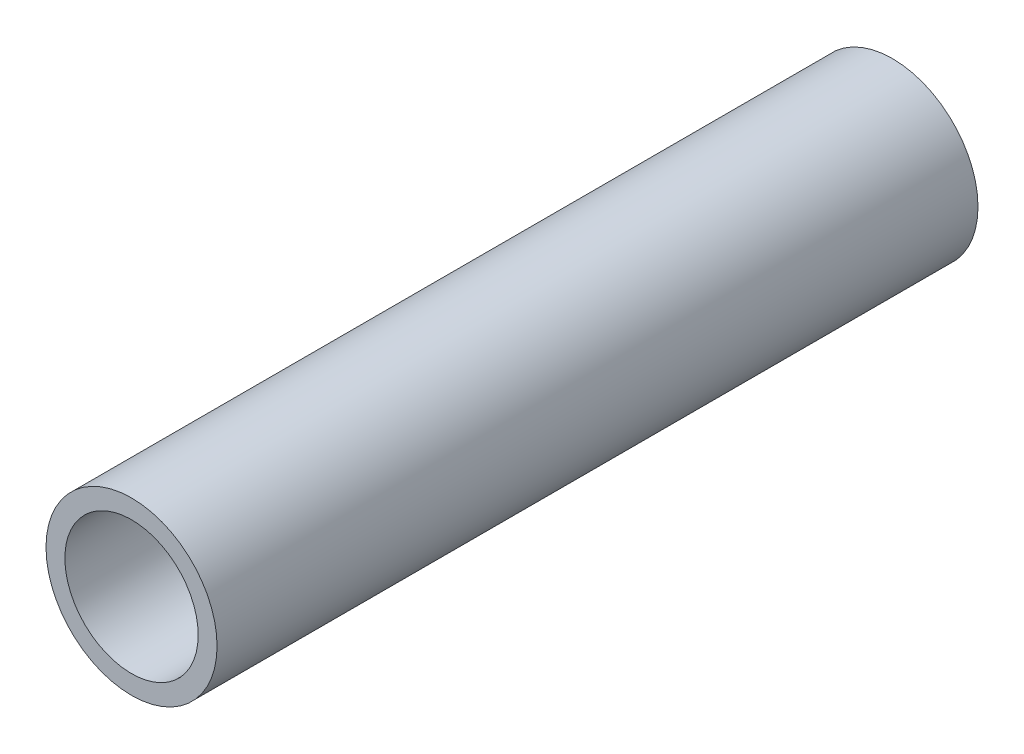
from build123d import *

# Parameters (mm, degrees)
SKETCH1_R           = 7.1374
SKETCH1_R_2         = 5.5626
EXTRUDE_THIN1_DEPTH = 63.5


with BuildPart() as part:
    # Sketch1 → Extrude-Thin1 (new body)
    with BuildSketch(Plane.XY):
        Circle(SKETCH1_R)
        Circle(SKETCH1_R_2, mode=Mode.SUBTRACT)
    extrude(amount=EXTRUDE_THIN1_DEPTH)


solid = part.part
